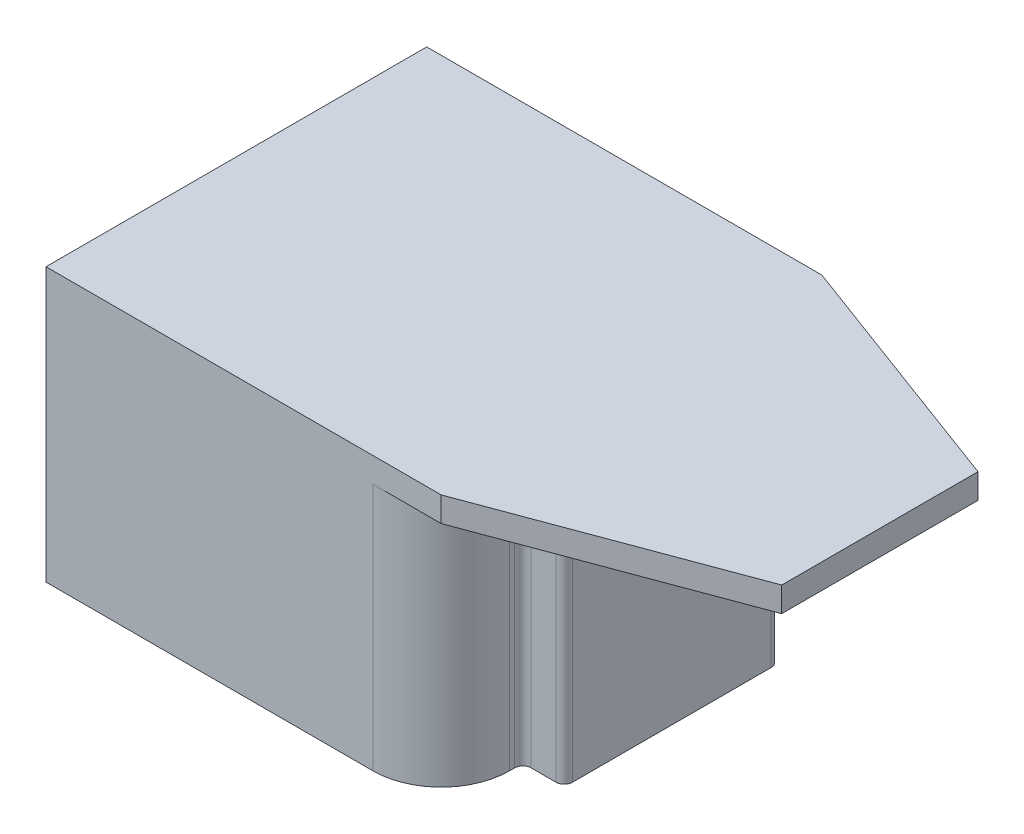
from build123d import *

# Parameters (mm, degrees)
SALIENTE_EXTRUIR1_DEPTH = 60
SALIENTE_EXTRUIR2_DEPTH = 6
CROQUIS3_W              = 40
CROQUIS3_H              = 10
CORTAR_EXTRUIR1_DEPTH   = 128.954093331


with BuildPart() as part:
    # Croquis1 → Saliente-Extruir1 (new body)
    with BuildSketch(Plane(origin=(0, 0, 0), x_dir=(1, 0, 0), z_dir=(0, 1, 0))):
        with BuildLine():
            Line((-39.500000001, 46), (39.513880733, 46))
            ThreePointArc((39.513880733, 46), (51.41797506, 40.925521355), (56, 28.823337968))
            Line((56, 28.823337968), (56, 27.730137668))
            ThreePointArc((56, 27.730137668), (56.585786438, 26.315924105), (58, 25.730137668))
            Line((58, 25.730137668), (64, 25.730137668))
            ThreePointArc((64, 25.730137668), (65.414213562, 25.14435123), (66, 23.730137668))
            Line((66, 23.730137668), (66, -24.269862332))
            ThreePointArc((66, -24.269862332), (65.414213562, -25.684075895), (64, -26.269862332))
            Line((64, -26.269862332), (58, -26.269862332))
            ThreePointArc((58, -26.269862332), (56.585786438, -26.85564877), (56, -28.269862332))
            Line((56, -28.269862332), (56, -29.5))
            ThreePointArc((56, -29.5), (51.16726189, -41.16726189), (39.5, -46))
            Line((39.5, -46), (-39.500000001, -46))
            Line((-39.500000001, -46), (-39.500000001, -40))
            Line((-39.500000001, -40), (39.5, -40))
            ThreePointArc((39.5, -40), (46.924621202, -36.924621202), (50, -29.5))
            Line((50, -29.5), (50, -20.269862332))
            Line((50, -20.269862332), (60, -20.269862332))
            Line((60, -20.269862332), (60, 19.730137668))
            Line((60, 19.730137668), (50, 19.730137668))
            Line((50, 19.730137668), (50, 28.960275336))
            ThreePointArc((50, 28.960275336), (47.126932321, 36.731282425), (39.513880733, 40))
            Line((39.513880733, 40), (-39.500000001, 40))
            Line((-39.500000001, 40), (-39.500000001, 46))
        make_face()
    extrude(amount=SALIENTE_EXTRUIR1_DEPTH)

    # Croquis2 → Saliente-Extruir2 (add)
    with BuildSketch(Plane(origin=(0, 60, 0), x_dir=(1, 0, 0), z_dir=(0, 1, 0))):
        Polygon((56, 46), (-39.500000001, 46), (-39.500000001, -46), (56, -46), (116, -23.714285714), (116, 23.714285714), align=None)
    extrude(amount=SALIENTE_EXTRUIR2_DEPTH)

    # Croquis3 → Cortar-Extruir1 (cut, through all)
    with BuildSketch(Plane.ZY.offset(-60)):
        with Locations((0.269862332, 55)):
            Rectangle(CROQUIS3_W, CROQUIS3_H)
    extrude(amount=-CORTAR_EXTRUIR1_DEPTH, mode=Mode.SUBTRACT)


solid = part.part
